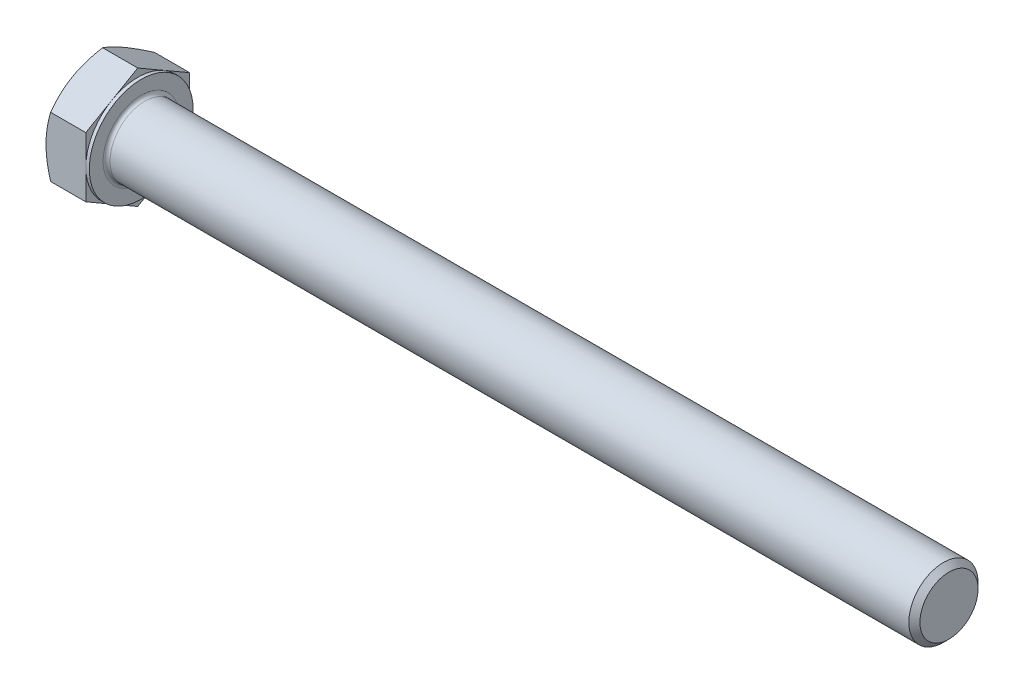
ISO-10303-21;
HEADER;
FILE_DESCRIPTION(('STEP AP214'),'2;1');
FILE_NAME('part.step','',(''),(''),'','','');
FILE_SCHEMA(('AUTOMOTIVE_DESIGN { 1 0 10303 214 1 1 1 1 }'));
ENDSEC;
DATA;
#1=APPLICATION_CONTEXT('core data for automotive mechanical design processes');
#2=APPLICATION_PROTOCOL_DEFINITION('international standard','automotive_design',2000,#1);
#3=PRODUCT_CONTEXT('',#1,'mechanical');
#4=PRODUCT('Part','Part','',(#3));
#5=PRODUCT_RELATED_PRODUCT_CATEGORY('part','',(#4));
#6=PRODUCT_DEFINITION_FORMATION('','',#4);
#7=PRODUCT_DEFINITION_CONTEXT('part definition',#1,'design');
#8=PRODUCT_DEFINITION('design','',#6,#7);
#9=PRODUCT_DEFINITION_SHAPE('','',#8);
#10=(LENGTH_UNIT() NAMED_UNIT(*) SI_UNIT(.MILLI.,.METRE.));
#11=(NAMED_UNIT(*) PLANE_ANGLE_UNIT() SI_UNIT($,.RADIAN.));
#12=(NAMED_UNIT(*) SI_UNIT($,.STERADIAN.) SOLID_ANGLE_UNIT());
#13=UNCERTAINTY_MEASURE_WITH_UNIT(LENGTH_MEASURE(1.E-05),#10,'distance_accuracy_value','');
#14=(GEOMETRIC_REPRESENTATION_CONTEXT(3) GLOBAL_UNCERTAINTY_ASSIGNED_CONTEXT((#13)) GLOBAL_UNIT_ASSIGNED_CONTEXT((#10,
#11,#12)) REPRESENTATION_CONTEXT('',''));
#15=CARTESIAN_POINT('',(0.,0.,0.));
#16=DIRECTION('',(0.,0.,1.));
#17=DIRECTION('',(1.,0.,0.));
#18=AXIS2_PLACEMENT_3D('',#15,#16,#17);
#19=CARTESIAN_POINT('',(7.5,10.3923048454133,0.));
#20=DIRECTION('',(1.,0.,0.));
#21=DIRECTION('',(0.,0.,-1.));
#22=AXIS2_PLACEMENT_3D('',#19,#20,#21);
#23=PLANE('',#22);
#24=CARTESIAN_POINT('',(7.5,0.,0.));
#25=DIRECTION('',(1.,0.,0.));
#26=DIRECTION('',(0.,0.,-1.));
#27=AXIS2_PLACEMENT_3D('',#24,#25,#26);
#28=CIRCLE('',#27,6.6);
#29=CARTESIAN_POINT('',(7.5,0.,-6.6));
#30=VERTEX_POINT('',#29);
#31=EDGE_CURVE('E40',#30,#30,#28,.F.);
#32=ORIENTED_EDGE('',*,*,#31,.T.);
#33=EDGE_LOOP('',(#32));
#34=FACE_BOUND('',#33,.T.);
#35=CARTESIAN_POINT('',(7.5,0.,0.));
#36=DIRECTION('',(1.,0.,0.));
#37=DIRECTION('',(0.,0.,-1.));
#38=AXIS2_PLACEMENT_3D('',#35,#36,#37);
#39=CIRCLE('',#38,9.);
#40=CARTESIAN_POINT('',(7.5,0.,-9.));
#41=VERTEX_POINT('',#40);
#42=EDGE_CURVE('E297',#41,#41,#39,.T.);
#43=ORIENTED_EDGE('',*,*,#42,.T.);
#44=EDGE_LOOP('',(#43));
#45=FACE_BOUND('',#44,.T.);
#46=ADVANCED_FACE('F32',(#34,#45),#23,.T.);
#47=CARTESIAN_POINT('',(0.,0.,0.));
#48=DIRECTION('',(-1.,0.,0.));
#49=DIRECTION('',(0.,0.,1.));
#50=AXIS2_PLACEMENT_3D('',#47,#48,#49);
#51=CYLINDRICAL_SURFACE('',#50,6.);
#52=CARTESIAN_POINT('',(8.1,0.,0.));
#53=DIRECTION('',(1.,0.,0.));
#54=DIRECTION('',(0.,0.,-1.));
#55=AXIS2_PLACEMENT_3D('',#52,#53,#54);
#56=CIRCLE('',#55,6.);
#57=CARTESIAN_POINT('',(8.1,0.,-6.));
#58=VERTEX_POINT('',#57);
#59=EDGE_CURVE('E11',#58,#58,#56,.T.);
#60=ORIENTED_EDGE('',*,*,#59,.T.);
#61=EDGE_LOOP('',(#60));
#62=FACE_BOUND('',#61,.T.);
#63=CARTESIAN_POINT('',(146.536,0.,0.));
#64=DIRECTION('',(-1.,0.,0.));
#65=DIRECTION('',(0.,0.,1.));
#66=AXIS2_PLACEMENT_3D('',#63,#64,#65);
#67=CIRCLE('',#66,6.);
#68=CARTESIAN_POINT('',(146.536,0.,6.));
#69=VERTEX_POINT('',#68);
#70=EDGE_CURVE('E276',#69,#69,#67,.T.);
#71=ORIENTED_EDGE('',*,*,#70,.T.);
#72=EDGE_LOOP('',(#71));
#73=FACE_BOUND('',#72,.T.);
#74=ADVANCED_FACE('F250',(#62,#73),#51,.T.);
#75=CARTESIAN_POINT('',(147.5,0.,0.));
#76=DIRECTION('',(-1.,0.,0.));
#77=DIRECTION('',(0.,0.,1.));
#78=AXIS2_PLACEMENT_3D('',#75,#76,#77);
#79=CONICAL_SURFACE('',#78,5.036,0.785398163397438);
#80=ORIENTED_EDGE('',*,*,#70,.F.);
#81=EDGE_LOOP('',(#80));
#82=FACE_BOUND('',#81,.T.);
#83=CARTESIAN_POINT('',(147.5,0.,0.));
#84=DIRECTION('',(-1.,0.,0.));
#85=DIRECTION('',(0.,0.,1.));
#86=AXIS2_PLACEMENT_3D('',#83,#84,#85);
#87=CIRCLE('',#86,5.036);
#88=CARTESIAN_POINT('',(147.5,0.,5.036));
#89=VERTEX_POINT('',#88);
#90=EDGE_CURVE('E274',#89,#89,#87,.T.);
#91=ORIENTED_EDGE('',*,*,#90,.T.);
#92=EDGE_LOOP('',(#91));
#93=FACE_BOUND('',#92,.T.);
#94=ADVANCED_FACE('F255',(#82,#93),#79,.T.);
#95=CARTESIAN_POINT('',(147.5,0.,0.));
#96=DIRECTION('',(-1.,0.,0.));
#97=DIRECTION('',(0.,0.,1.));
#98=AXIS2_PLACEMENT_3D('',#95,#96,#97);
#99=PLANE('',#98);
#100=ORIENTED_EDGE('',*,*,#90,.F.);
#101=EDGE_LOOP('',(#100));
#102=FACE_BOUND('',#101,.T.);
#103=ADVANCED_FACE('F262',(#102),#99,.F.);
#104=CARTESIAN_POINT('',(6.9,9.,0.));
#105=DIRECTION('',(1.,0.,0.));
#106=DIRECTION('',(0.,0.,-1.));
#107=AXIS2_PLACEMENT_3D('',#104,#105,#106);
#108=PLANE('',#107);
#109=DIRECTION('',(0.,0.500000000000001,0.866025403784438));
#110=VECTOR('',#109,1.);
#111=CARTESIAN_POINT('',(6.9,5.19615242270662,-9.));
#112=LINE('',#111,#110);
#113=CARTESIAN_POINT('',(6.9,5.19615242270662,-9.));
#114=VERTEX_POINT('',#113);
#115=CARTESIAN_POINT('',(6.9,7.79422863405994,-4.50000000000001));
#116=VERTEX_POINT('',#115);
#117=EDGE_CURVE('E164',#114,#116,#112,.T.);
#118=ORIENTED_EDGE('',*,*,#117,.T.);
#119=CARTESIAN_POINT('',(6.9,0.,0.));
#120=DIRECTION('',(-1.,0.,0.));
#121=DIRECTION('',(0.,0.,1.));
#122=AXIS2_PLACEMENT_3D('',#119,#120,#121);
#123=CIRCLE('',#122,9.);
#124=CARTESIAN_POINT('',(6.9,0.,-9.));
#125=VERTEX_POINT('',#124);
#126=EDGE_CURVE('E47',#116,#125,#123,.T.);
#127=ORIENTED_EDGE('',*,*,#126,.T.);
#128=DIRECTION('',(0.,1.,0.));
#129=VECTOR('',#128,1.);
#130=CARTESIAN_POINT('',(6.9,5.19615242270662,-9.));
#131=LINE('',#130,#129);
#132=EDGE_CURVE('E300',#125,#114,#131,.T.);
#133=ORIENTED_EDGE('',*,*,#132,.T.);
#134=EDGE_LOOP('',(#118,#127,#133));
#135=FACE_BOUND('',#134,.T.);
#136=ADVANCED_FACE('F265',(#135),#108,.T.);
#137=CARTESIAN_POINT('',(6.9,10.3923048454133,0.));
#138=VERTEX_POINT('',#137);
#139=EDGE_CURVE('E162',#116,#138,#112,.T.);
#140=ORIENTED_EDGE('',*,*,#139,.T.);
#141=DIRECTION('',(0.,-0.500000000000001,0.866025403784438));
#142=VECTOR('',#141,1.);
#143=CARTESIAN_POINT('',(6.9,10.3923048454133,0.));
#144=LINE('',#143,#142);
#145=CARTESIAN_POINT('',(6.9,7.79422863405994,4.50000000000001));
#146=VERTEX_POINT('',#145);
#147=EDGE_CURVE('E161',#138,#146,#144,.T.);
#148=ORIENTED_EDGE('',*,*,#147,.T.);
#149=EDGE_CURVE('E150',#146,#116,#123,.T.);
#150=ORIENTED_EDGE('',*,*,#149,.T.);
#151=EDGE_LOOP('',(#140,#148,#150));
#152=FACE_BOUND('',#151,.T.);
#153=ADVANCED_FACE('F270',(#152),#108,.T.);
#154=CARTESIAN_POINT('',(6.9,5.19615242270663,9.));
#155=VERTEX_POINT('',#154);
#156=EDGE_CURVE('E129',#146,#155,#144,.T.);
#157=ORIENTED_EDGE('',*,*,#156,.T.);
#158=DIRECTION('',(0.,-1.,0.));
#159=VECTOR('',#158,1.);
#160=CARTESIAN_POINT('',(6.9,5.19615242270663,9.));
#161=LINE('',#160,#159);
#162=CARTESIAN_POINT('',(6.9,0.,9.));
#163=VERTEX_POINT('',#162);
#164=EDGE_CURVE('E123',#155,#163,#161,.T.);
#165=ORIENTED_EDGE('',*,*,#164,.T.);
#166=EDGE_CURVE('E127',#163,#146,#123,.T.);
#167=ORIENTED_EDGE('',*,*,#166,.T.);
#168=EDGE_LOOP('',(#157,#165,#167));
#169=FACE_BOUND('',#168,.T.);
#170=ADVANCED_FACE('F125',(#169),#108,.T.);
#171=CARTESIAN_POINT('',(6.9,-5.19615242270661,9.));
#172=VERTEX_POINT('',#171);
#173=EDGE_CURVE('E133',#163,#172,#161,.T.);
#174=ORIENTED_EDGE('',*,*,#173,.T.);
#175=DIRECTION('',(0.,-0.500000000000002,-0.866025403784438));
#176=VECTOR('',#175,1.);
#177=CARTESIAN_POINT('',(6.9,-10.3923048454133,0.));
#178=LINE('',#177,#176);
#179=CARTESIAN_POINT('',(6.9,-7.79422863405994,4.50000000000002));
#180=VERTEX_POINT('',#179);
#181=EDGE_CURVE('E140',#172,#180,#178,.T.);
#182=ORIENTED_EDGE('',*,*,#181,.T.);
#183=EDGE_CURVE('E137',#180,#163,#123,.T.);
#184=ORIENTED_EDGE('',*,*,#183,.T.);
#185=EDGE_LOOP('',(#174,#182,#184));
#186=FACE_BOUND('',#185,.T.);
#187=ADVANCED_FACE('F138',(#186),#108,.T.);
#188=CARTESIAN_POINT('',(6.9,-10.3923048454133,0.));
#189=VERTEX_POINT('',#188);
#190=EDGE_CURVE('E156',#180,#189,#178,.T.);
#191=ORIENTED_EDGE('',*,*,#190,.T.);
#192=DIRECTION('',(0.,0.5,-0.866025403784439));
#193=VECTOR('',#192,1.);
#194=CARTESIAN_POINT('',(6.9,-5.19615242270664,-9.));
#195=LINE('',#194,#193);
#196=CARTESIAN_POINT('',(6.9,-7.79422863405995,-4.5));
#197=VERTEX_POINT('',#196);
#198=EDGE_CURVE('E338',#189,#197,#195,.T.);
#199=ORIENTED_EDGE('',*,*,#198,.T.);
#200=EDGE_CURVE('E144',#197,#180,#123,.T.);
#201=ORIENTED_EDGE('',*,*,#200,.T.);
#202=EDGE_LOOP('',(#191,#199,#201));
#203=FACE_BOUND('',#202,.T.);
#204=ADVANCED_FACE('F339',(#203),#108,.T.);
#205=CARTESIAN_POINT('',(6.9,-5.19615242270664,-9.));
#206=VERTEX_POINT('',#205);
#207=EDGE_CURVE('E151',#197,#206,#195,.T.);
#208=ORIENTED_EDGE('',*,*,#207,.T.);
#209=EDGE_CURVE('E301',#206,#125,#131,.T.);
#210=ORIENTED_EDGE('',*,*,#209,.T.);
#211=EDGE_CURVE('E308',#125,#197,#123,.T.);
#212=ORIENTED_EDGE('',*,*,#211,.T.);
#213=EDGE_LOOP('',(#208,#210,#212));
#214=FACE_BOUND('',#213,.T.);
#215=ADVANCED_FACE('F271',(#214),#108,.T.);
#216=CARTESIAN_POINT('',(0.,0.,0.));
#217=DIRECTION('',(-1.,0.,0.));
#218=DIRECTION('',(0.,0.,1.));
#219=AXIS2_PLACEMENT_3D('',#216,#217,#218);
#220=CYLINDRICAL_SURFACE('',#219,9.);
#221=ORIENTED_EDGE('',*,*,#126,.F.);
#222=ORIENTED_EDGE('',*,*,#149,.F.);
#223=ORIENTED_EDGE('',*,*,#166,.F.);
#224=ORIENTED_EDGE('',*,*,#183,.F.);
#225=ORIENTED_EDGE('',*,*,#200,.F.);
#226=ORIENTED_EDGE('',*,*,#211,.F.);
#227=EDGE_LOOP('',(#221,#222,#223,#224,#225,#226));
#228=FACE_BOUND('',#227,.T.);
#229=ORIENTED_EDGE('',*,*,#42,.F.);
#230=EDGE_LOOP('',(#229));
#231=FACE_BOUND('',#230,.T.);
#232=ADVANCED_FACE('F147',(#228,#231),#220,.T.);
#233=CARTESIAN_POINT('',(0.,10.3923048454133,0.));
#234=DIRECTION('',(1.,0.,0.));
#235=DIRECTION('',(0.,0.,-1.));
#236=AXIS2_PLACEMENT_3D('',#233,#234,#235);
#237=PLANE('',#236);
#238=CARTESIAN_POINT('',(0.,0.,0.));
#239=DIRECTION('',(1.,0.,0.));
#240=DIRECTION('',(0.,0.,-1.));
#241=AXIS2_PLACEMENT_3D('',#238,#239,#240);
#242=CIRCLE('',#241,9.);
#243=CARTESIAN_POINT('',(0.,0.,-9.));
#244=VERTEX_POINT('',#243);
#245=CARTESIAN_POINT('',(0.,7.79422863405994,-4.50000000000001));
#246=VERTEX_POINT('',#245);
#247=EDGE_CURVE('E296',#244,#246,#242,.T.);
#248=ORIENTED_EDGE('',*,*,#247,.F.);
#249=CARTESIAN_POINT('',(0.,-7.79422863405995,-4.5));
#250=VERTEX_POINT('',#249);
#251=EDGE_CURVE('E292',#250,#244,#242,.T.);
#252=ORIENTED_EDGE('',*,*,#251,.F.);
#253=CARTESIAN_POINT('',(0.,-7.79422863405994,4.50000000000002));
#254=VERTEX_POINT('',#253);
#255=EDGE_CURVE('E295',#254,#250,#242,.T.);
#256=ORIENTED_EDGE('',*,*,#255,.F.);
#257=CARTESIAN_POINT('',(0.,0.,9.));
#258=VERTEX_POINT('',#257);
#259=EDGE_CURVE('E331',#258,#254,#242,.T.);
#260=ORIENTED_EDGE('',*,*,#259,.F.);
#261=CARTESIAN_POINT('',(0.,0.,0.));
#262=DIRECTION('',(-1.,0.,0.));
#263=DIRECTION('',(0.,0.,1.));
#264=AXIS2_PLACEMENT_3D('',#261,#262,#263);
#265=CIRCLE('',#264,9.);
#266=CARTESIAN_POINT('',(0.,7.79422863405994,4.50000000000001));
#267=VERTEX_POINT('',#266);
#268=EDGE_CURVE('E165',#258,#267,#265,.T.);
#269=ORIENTED_EDGE('',*,*,#268,.T.);
#270=EDGE_CURVE('E354',#246,#267,#242,.T.);
#271=ORIENTED_EDGE('',*,*,#270,.F.);
#272=EDGE_LOOP('',(#248,#252,#256,#260,#269,#271));
#273=FACE_BOUND('',#272,.T.);
#274=ADVANCED_FACE('F196',(#273),#237,.F.);
#275=CARTESIAN_POINT('',(0.,0.,0.));
#276=DIRECTION('',(1.,0.,0.));
#277=DIRECTION('',(0.,0.,-1.));
#278=AXIS2_PLACEMENT_3D('',#275,#276,#277);
#279=CONICAL_SURFACE('',#278,9.,1.0471975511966);
#280=CARTESIAN_POINT('',(0.803914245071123,5.19603695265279,9.0002));
#281=CARTESIAN_POINT('',(0.737982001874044,5.31024090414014,8.80239295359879));
#282=CARTESIAN_POINT('',(0.675041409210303,5.42489028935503,8.60381439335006));
#283=CARTESIAN_POINT('',(0.555968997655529,5.65512011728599,8.20504463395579));
#284=CARTESIAN_POINT('',(0.499840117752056,5.77070093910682,8.00485277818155));
#285=CARTESIAN_POINT('',(0.395151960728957,6.00300811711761,7.60248494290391));
#286=CARTESIAN_POINT('',(0.346610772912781,6.11973652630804,7.40030540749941));
#287=CARTESIAN_POINT('',(0.258148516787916,6.35398725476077,6.99457124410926));
#288=CARTESIAN_POINT('',(0.218225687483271,6.47150940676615,6.7910169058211));
#289=CARTESIAN_POINT('',(0.148684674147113,6.70436794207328,6.38769409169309));
#290=CARTESIAN_POINT('',(0.118837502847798,6.81968712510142,6.187955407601));
#291=CARTESIAN_POINT('',(0.0687933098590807,7.05084147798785,5.78758432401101));
#292=CARTESIAN_POINT('',(0.04859543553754,7.16667660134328,5.5869520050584));
#293=CARTESIAN_POINT('',(0.0183543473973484,7.39854776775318,5.18533936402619));
#294=CARTESIAN_POINT('',(0.00829960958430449,7.51458343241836,4.98435969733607));
#295=CARTESIAN_POINT('',(-0.00143766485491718,7.74676155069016,4.58221540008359));
#296=CARTESIAN_POINT('',(-0.00112052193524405,7.86290400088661,4.38105077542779));
#297=CARTESIAN_POINT('',(0.00916395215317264,8.08003584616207,4.00496738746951));
#298=CARTESIAN_POINT('',(0.0178767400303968,8.18104055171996,3.83002210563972));
#299=CARTESIAN_POINT('',(0.0429773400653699,8.38281337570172,3.48054132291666));
#300=CARTESIAN_POINT('',(0.0593656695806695,8.4835814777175,3.30600585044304));
#301=CARTESIAN_POINT('',(0.11965655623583,8.7854956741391,2.7830751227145));
#302=CARTESIAN_POINT('',(0.174677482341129,8.98610736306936,2.43560548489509));
#303=CARTESIAN_POINT('',(0.312230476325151,9.38945876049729,1.73698037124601));
#304=CARTESIAN_POINT('',(0.395345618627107,9.59214699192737,1.38591405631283));
#305=CARTESIAN_POINT('',(0.583982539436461,9.99450087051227,0.689016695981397));
#306=CARTESIAN_POINT('',(0.689460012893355,10.1941716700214,0.343176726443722));
#307=CARTESIAN_POINT('',(0.803914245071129,10.3924203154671,-0.000200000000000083));
#308=B_SPLINE_CURVE_WITH_KNOTS('',3,(#280,#281,#282,#283,#284,#285,#286,#287,#288,#289,#290,
#291,#292,#293,#294,#295,#296,#297,#298,#299,#300,#301,#302,#303,#304,#305,#306,#307),
.UNSPECIFIED.,.F.,.F.,(4,2,2,2,2,2,2,2,2,2,2,2,2,4),(0.,0.713219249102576,1.42674513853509,
2.14194697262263,2.8570025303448,3.55449749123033,4.25193080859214,4.94857085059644,
5.64518936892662,6.25162976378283,6.8581110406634,8.07193747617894,9.31268391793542,
10.5509947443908),.UNSPECIFIED.);
#309=CARTESIAN_POINT('',(0.803847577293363,10.3923048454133,0.));
#310=VERTEX_POINT('',#309);
#311=EDGE_CURVE('E216',#267,#310,#308,.T.);
#312=ORIENTED_EDGE('',*,*,#311,.T.);
#313=CARTESIAN_POINT('',(0.803914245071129,10.3924203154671,0.0002));
#314=CARTESIAN_POINT('',(0.73798200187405,10.2782163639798,-0.197607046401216));
#315=CARTESIAN_POINT('',(0.675041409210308,10.1635669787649,-0.396185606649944));
#316=CARTESIAN_POINT('',(0.555968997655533,9.93333715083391,-0.794955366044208));
#317=CARTESIAN_POINT('',(0.49984011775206,9.81775632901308,-0.995147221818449));
#318=CARTESIAN_POINT('',(0.395151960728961,9.58544915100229,-1.3975150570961));
#319=CARTESIAN_POINT('',(0.346610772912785,9.46872074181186,-1.5996945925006));
#320=CARTESIAN_POINT('',(0.258148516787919,9.23447001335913,-2.00542875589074));
#321=CARTESIAN_POINT('',(0.218225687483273,9.11694786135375,-2.20898309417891));
#322=CARTESIAN_POINT('',(0.148684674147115,8.88408932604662,-2.61230590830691));
#323=CARTESIAN_POINT('',(0.1188375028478,8.76877014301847,-2.812044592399));
#324=CARTESIAN_POINT('',(0.0687933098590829,8.53761579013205,-3.21241567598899));
#325=CARTESIAN_POINT('',(0.0485954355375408,8.42178066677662,-3.4130479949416));
#326=CARTESIAN_POINT('',(0.0183543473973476,8.18990950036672,-3.81466063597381));
#327=CARTESIAN_POINT('',(0.00829960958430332,8.07387383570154,-4.01564030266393));
#328=CARTESIAN_POINT('',(-0.00143766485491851,7.84169571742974,-4.41778459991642));
#329=CARTESIAN_POINT('',(-0.00112052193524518,7.72555326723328,-4.61894922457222));
#330=CARTESIAN_POINT('',(0.00916395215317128,7.50842142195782,-4.9950326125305));
#331=CARTESIAN_POINT('',(0.0178767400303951,7.40741671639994,-5.16997789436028));
#332=CARTESIAN_POINT('',(0.0429773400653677,7.20564389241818,-5.51945867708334));
#333=CARTESIAN_POINT('',(0.0593656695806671,7.1048757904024,-5.69399414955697));
#334=CARTESIAN_POINT('',(0.119656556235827,6.8029615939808,-6.2169248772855));
#335=CARTESIAN_POINT('',(0.174677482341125,6.60234990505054,-6.56439451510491));
#336=CARTESIAN_POINT('',(0.312230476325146,6.1989985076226,-7.263019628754));
#337=CARTESIAN_POINT('',(0.395345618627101,5.99631027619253,-7.61408594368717));
#338=CARTESIAN_POINT('',(0.583982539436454,5.59395639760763,-8.3109833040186));
#339=CARTESIAN_POINT('',(0.689460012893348,5.39428559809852,-8.65682327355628));
#340=CARTESIAN_POINT('',(0.803914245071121,5.19603695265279,-9.0002));
#341=B_SPLINE_CURVE_WITH_KNOTS('',3,(#313,#314,#315,#316,#317,#318,#319,#320,#321,#322,#323,
#324,#325,#326,#327,#328,#329,#330,#331,#332,#333,#334,#335,#336,#337,#338,#339,#340),
.UNSPECIFIED.,.F.,.F.,(4,2,2,2,2,2,2,2,2,2,2,2,2,4),(0.,0.713219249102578,1.42674513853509,
2.14194697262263,2.8570025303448,3.55449749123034,4.25193080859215,4.94857085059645,
5.64518936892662,6.25162976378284,6.8581110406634,8.07193747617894,9.31268391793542,
10.5509947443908),.UNSPECIFIED.);
#342=EDGE_CURVE('E55',#310,#246,#341,.T.);
#343=ORIENTED_EDGE('',*,*,#342,.T.);
#344=ORIENTED_EDGE('',*,*,#270,.T.);
#345=EDGE_LOOP('',(#312,#343,#344));
#346=FACE_BOUND('',#345,.T.);
#347=ADVANCED_FACE('F355',(#346),#279,.T.);
#348=CARTESIAN_POINT('',(4.50308345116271,-14.1853984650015,8.99999999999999));
#349=CARTESIAN_POINT('',(4.31054430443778,-13.7903499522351,8.99999999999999));
#350=CARTESIAN_POINT('',(4.11978647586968,-13.3944187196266,8.99999999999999));
#351=CARTESIAN_POINT('',(3.74283090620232,-12.6003222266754,8.99999999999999));
#352=CARTESIAN_POINT('',(3.55663384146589,-12.2021566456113,9.));
#353=CARTESIAN_POINT('',(3.18890856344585,-11.4011783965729,9.));
#354=CARTESIAN_POINT('',(3.00740939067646,-10.9983523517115,9.));
#355=CARTESIAN_POINT('',(2.65153988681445,-10.1895752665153,9.));
#356=CARTESIAN_POINT('',(2.4771692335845,-9.78362436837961,9.));
#357=CARTESIAN_POINT('',(2.13161244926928,-8.95398189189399,9.));
#358=CARTESIAN_POINT('',(1.96074001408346,-8.53015895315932,9.));
#359=CARTESIAN_POINT('',(1.63138410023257,-7.6776404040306,9.));
#360=CARTESIAN_POINT('',(1.47290197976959,-7.24894426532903,9.));
#361=CARTESIAN_POINT('',(1.17232155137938,-6.38672363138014,9.));
#362=CARTESIAN_POINT('',(1.03019194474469,-5.95321016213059,9.));
#363=CARTESIAN_POINT('',(0.766724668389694,-5.07998336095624,9.));
#364=CARTESIAN_POINT('',(0.645380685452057,-4.64027195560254,9.));
#365=CARTESIAN_POINT('',(0.429822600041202,-3.75682505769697,9.));
#366=CARTESIAN_POINT('',(0.335452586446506,-3.31312863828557,9.));
#367=CARTESIAN_POINT('',(0.218090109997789,-2.6433671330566,9.));
#368=CARTESIAN_POINT('',(0.182999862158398,-2.41939560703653,9.));
#369=CARTESIAN_POINT('',(0.121565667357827,-1.9702635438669,9.));
#370=CARTESIAN_POINT('',(0.095220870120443,-1.74510312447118,9.));
#371=CARTESIAN_POINT('',(0.0521451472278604,-1.29693480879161,9.));
#372=CARTESIAN_POINT('',(0.0352889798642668,-1.07393900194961,9.));
#373=CARTESIAN_POINT('',(0.0110310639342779,-0.627433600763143,9.));
#374=CARTESIAN_POINT('',(0.00362915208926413,-0.403924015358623,9.));
#375=CARTESIAN_POINT('',(-0.00154262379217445,0.0432079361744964,9.));
#376=CARTESIAN_POINT('',(0.000687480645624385,0.266830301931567,9.));
#377=CARTESIAN_POINT('',(0.0147226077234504,0.713776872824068,9.));
#378=CARTESIAN_POINT('',(0.0265280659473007,0.937101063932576,9.));
#379=CARTESIAN_POINT('',(0.065650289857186,1.46707211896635,9.));
#380=CARTESIAN_POINT('',(0.0971347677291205,1.77341845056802,9.));
#381=CARTESIAN_POINT('',(0.176454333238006,2.38397028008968,9.));
#382=CARTESIAN_POINT('',(0.224291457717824,2.68817550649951,9.));
#383=CARTESIAN_POINT('',(0.389806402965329,3.59715813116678,9.));
#384=CARTESIAN_POINT('',(0.52946189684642,4.19799412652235,9.));
#385=CARTESIAN_POINT('',(0.773331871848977,5.09670706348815,9.));
#386=CARTESIAN_POINT('',(0.861532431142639,5.399199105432,9.));
#387=CARTESIAN_POINT('',(1.04752099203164,6.00125026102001,9.));
#388=CARTESIAN_POINT('',(1.14530906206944,6.30080935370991,9.));
#389=CARTESIAN_POINT('',(1.34886866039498,6.89708058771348,9.));
#390=CARTESIAN_POINT('',(1.45463787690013,7.19379352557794,9.));
#391=CARTESIAN_POINT('',(1.67287301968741,7.78473287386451,9.));
#392=CARTESIAN_POINT('',(1.78533883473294,8.07895932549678,9.));
#393=CARTESIAN_POINT('',(2.07523735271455,8.81619444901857,9.));
#394=CARTESIAN_POINT('',(2.25629467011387,9.25777584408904,9.));
#395=CARTESIAN_POINT('',(2.62827522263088,10.1367776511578,9.));
#396=CARTESIAN_POINT('',(2.819199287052,10.5741977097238,9.));
#397=CARTESIAN_POINT('',(3.20877963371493,11.4457286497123,9.));
#398=CARTESIAN_POINT('',(3.40743823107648,11.8798384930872,9.));
#399=CARTESIAN_POINT('',(3.81079737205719,12.7452179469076,9.));
#400=CARTESIAN_POINT('',(4.01549773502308,13.176487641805,9.00000000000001));
#401=CARTESIAN_POINT('',(4.43000777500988,14.0372827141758,9.00000000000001));
#402=CARTESIAN_POINT('',(4.63982402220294,14.4668049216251,9.00000000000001));
#403=CARTESIAN_POINT('',(5.06336871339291,15.3239162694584,9.00000000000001));
#404=CARTESIAN_POINT('',(5.27709718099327,15.7515053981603,9.00000000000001));
#405=CARTESIAN_POINT('',(5.70771289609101,16.6049951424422,9.00000000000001));
#406=CARTESIAN_POINT('',(5.92459958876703,17.0308960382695,9.00000000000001));
#407=CARTESIAN_POINT('',(6.36101693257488,17.8813418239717,9.00000000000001));
#408=CARTESIAN_POINT('',(6.58054759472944,18.305886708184,9.00000000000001));
#409=CARTESIAN_POINT('',(7.2009668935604,19.4981240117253,9.00000000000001));
#410=CARTESIAN_POINT('',(7.60436223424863,20.2645118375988,9.00000000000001));
#411=CARTESIAN_POINT('',(8.41646747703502,21.7945065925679,9.00000000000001));
#412=CARTESIAN_POINT('',(8.82517763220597,22.558113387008,9.00000000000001));
#413=CARTESIAN_POINT('',(9.64538992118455,24.0808854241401,9.00000000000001));
#414=CARTESIAN_POINT('',(10.0568800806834,24.8400571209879,9.00000000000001));
#415=CARTESIAN_POINT('',(10.6764233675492,25.9775231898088,9.00000000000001));
#416=CARTESIAN_POINT('',(10.8833155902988,26.3564507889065,9.00000000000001));
#417=CARTESIAN_POINT('',(11.2977907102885,27.1139273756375,9.00000000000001));
#418=CARTESIAN_POINT('',(11.5053736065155,27.492476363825,9.00000000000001));
#419=CARTESIAN_POINT('',(11.7132605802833,27.8708583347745,9.00000000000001));
#420=B_SPLINE_CURVE_WITH_KNOTS('',3,(#348,#349,#350,#351,#352,#353,#354,#355,#356,#357,#358,
#359,#360,#361,#362,#363,#364,#365,#366,#367,#368,#369,#370,#371,#372,#373,#374,#375,#376,#377,
#378,#379,#380,#381,#382,#383,#384,#385,#386,#387,#388,#389,#390,#391,#392,#393,#394,#395,#396,
#397,#398,#399,#400,#401,#402,#403,#404,#405,#406,#407,#408,#409,#410,#411,#412,#413,#414,#415,
#416,#417,#418,#419),.UNSPECIFIED.,.F.,.F.,(4,2,2,2,2,2,2,2,2,2,2,2,2,2,2,2,2,2,2,2,2,2,2,2,2,2,
2,2,2,2,2,2,2,2,2,4),(0.,1.31842765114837,2.6370496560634,3.96247407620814,5.28783853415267,
6.65860358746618,8.02951869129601,9.3977646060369,10.7655942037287,12.1253499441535,
12.8053173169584,13.4852185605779,14.1559216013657,14.8266130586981,15.4973023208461,
16.1680220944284,17.0913849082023,18.0148627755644,19.862742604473,20.8079230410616,
21.7531102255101,22.6980246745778,23.6429234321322,25.0745302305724,26.5062575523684,
27.9384167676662,29.3705332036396,30.8045973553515,32.2386701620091,33.6724940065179,
35.1063238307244,37.7045032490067,40.3028068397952,42.8933552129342,44.1885437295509,
45.4837303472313),.UNSPECIFIED.);
#421=CARTESIAN_POINT('',(0.803847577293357,5.19615242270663,9.));
#422=VERTEX_POINT('',#421);
#423=EDGE_CURVE('E230',#258,#422,#420,.T.);
#424=ORIENTED_EDGE('',*,*,#423,.T.);
#425=EDGE_CURVE('E229',#422,#267,#308,.T.);
#426=ORIENTED_EDGE('',*,*,#425,.T.);
#427=ORIENTED_EDGE('',*,*,#268,.F.);
#428=EDGE_LOOP('',(#424,#426,#427));
#429=FACE_BOUND('',#428,.T.);
#430=ADVANCED_FACE('F325',(#429),#279,.T.);
#431=CARTESIAN_POINT('',(0.80384757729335,-5.19615242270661,9.));
#432=VERTEX_POINT('',#431);
#433=EDGE_CURVE('E277',#432,#258,#420,.T.);
#434=ORIENTED_EDGE('',*,*,#433,.T.);
#435=ORIENTED_EDGE('',*,*,#259,.T.);
#436=CARTESIAN_POINT('',(0.803914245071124,-10.3924203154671,-0.000200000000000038));
#437=CARTESIAN_POINT('',(0.737982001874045,-10.2782163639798,0.197607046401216));
#438=CARTESIAN_POINT('',(0.675041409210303,-10.1635669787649,0.396185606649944));
#439=CARTESIAN_POINT('',(0.555968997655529,-9.9333371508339,0.794955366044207));
#440=CARTESIAN_POINT('',(0.499840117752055,-9.81775632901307,0.995147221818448));
#441=CARTESIAN_POINT('',(0.395151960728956,-9.58544915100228,1.39751505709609));
#442=CARTESIAN_POINT('',(0.34661077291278,-9.46872074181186,1.59969459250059));
#443=CARTESIAN_POINT('',(0.258148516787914,-9.23447001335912,2.00542875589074));
#444=CARTESIAN_POINT('',(0.218225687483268,-9.11694786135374,2.2089830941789));
#445=CARTESIAN_POINT('',(0.148684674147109,-8.88408932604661,2.61230590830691));
#446=CARTESIAN_POINT('',(0.118837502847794,-8.76877014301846,2.812044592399));
#447=CARTESIAN_POINT('',(0.0687933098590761,-8.53761579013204,3.21241567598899));
#448=CARTESIAN_POINT('',(0.0485954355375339,-8.42178066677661,3.4130479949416));
#449=CARTESIAN_POINT('',(0.0183543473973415,-8.18990950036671,3.81466063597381));
#450=CARTESIAN_POINT('',(0.00829960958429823,-8.07387383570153,4.01564030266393));
#451=CARTESIAN_POINT('',(-0.00143766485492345,-7.84169571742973,4.41778459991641));
#452=CARTESIAN_POINT('',(-0.00112052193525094,-7.72555326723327,4.61894922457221));
#453=CARTESIAN_POINT('',(0.00916395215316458,-7.50842142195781,4.99503261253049));
#454=CARTESIAN_POINT('',(0.0178767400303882,-7.40741671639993,5.16997789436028));
#455=CARTESIAN_POINT('',(0.0429773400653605,-7.20564389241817,5.51945867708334));
#456=CARTESIAN_POINT('',(0.0593656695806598,-7.10487579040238,5.69399414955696));
#457=CARTESIAN_POINT('',(0.11965655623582,-6.80296159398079,6.2169248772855));
#458=CARTESIAN_POINT('',(0.174677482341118,-6.60234990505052,6.56439451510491));
#459=CARTESIAN_POINT('',(0.31223047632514,-6.19899850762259,7.26301962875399));
#460=CARTESIAN_POINT('',(0.395345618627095,-5.99631027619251,7.61408594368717));
#461=CARTESIAN_POINT('',(0.583982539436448,-5.59395639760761,8.3109833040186));
#462=CARTESIAN_POINT('',(0.689460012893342,-5.39428559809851,8.65682327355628));
#463=CARTESIAN_POINT('',(0.803914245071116,-5.19603695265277,9.0002));
#464=B_SPLINE_CURVE_WITH_KNOTS('',3,(#436,#437,#438,#439,#440,#441,#442,#443,#444,#445,#446,
#447,#448,#449,#450,#451,#452,#453,#454,#455,#456,#457,#458,#459,#460,#461,#462,#463),
.UNSPECIFIED.,.F.,.F.,(4,2,2,2,2,2,2,2,2,2,2,2,2,4),(0.,0.713219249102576,1.42674513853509,
2.14194697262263,2.8570025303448,3.55449749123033,4.25193080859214,4.94857085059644,
5.64518936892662,6.25162976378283,6.8581110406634,8.07193747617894,9.31268391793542,
10.5509947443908),.UNSPECIFIED.);
#465=EDGE_CURVE('E218',#254,#432,#464,.T.);
#466=ORIENTED_EDGE('',*,*,#465,.T.);
#467=EDGE_LOOP('',(#434,#435,#466));
#468=FACE_BOUND('',#467,.T.);
#469=ADVANCED_FACE('F185',(#468),#279,.T.);
#470=CARTESIAN_POINT('',(0.803847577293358,-10.3923048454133,0.));
#471=VERTEX_POINT('',#470);
#472=EDGE_CURVE('E210',#471,#254,#464,.T.);
#473=ORIENTED_EDGE('',*,*,#472,.T.);
#474=ORIENTED_EDGE('',*,*,#255,.T.);
#475=CARTESIAN_POINT('',(0.803914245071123,-5.1960369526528,-9.0002));
#476=CARTESIAN_POINT('',(0.737982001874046,-5.31024090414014,-8.80239295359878));
#477=CARTESIAN_POINT('',(0.675041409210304,-5.42489028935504,-8.60381439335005));
#478=CARTESIAN_POINT('',(0.555968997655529,-5.655120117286,-8.20504463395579));
#479=CARTESIAN_POINT('',(0.499840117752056,-5.77070093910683,-8.00485277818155));
#480=CARTESIAN_POINT('',(0.395151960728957,-6.00300811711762,-7.6024849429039));
#481=CARTESIAN_POINT('',(0.346610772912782,-6.11973652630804,-7.4003054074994));
#482=CARTESIAN_POINT('',(0.258148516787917,-6.35398725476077,-6.99457124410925));
#483=CARTESIAN_POINT('',(0.218225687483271,-6.47150940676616,-6.79101690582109));
#484=CARTESIAN_POINT('',(0.148684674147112,-6.70436794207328,-6.38769409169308));
#485=CARTESIAN_POINT('',(0.118837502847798,-6.81968712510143,-6.187955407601));
#486=CARTESIAN_POINT('',(0.0687933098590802,-7.05084147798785,-5.787584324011));
#487=CARTESIAN_POINT('',(0.0485954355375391,-7.16667660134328,-5.58695200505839));
#488=CARTESIAN_POINT('',(0.0183543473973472,-7.39854776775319,-5.18533936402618));
#489=CARTESIAN_POINT('',(0.00829960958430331,-7.51458343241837,-4.98435969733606));
#490=CARTESIAN_POINT('',(-0.00143766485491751,-7.74676155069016,-4.58221540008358));
#491=CARTESIAN_POINT('',(-0.00112052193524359,-7.86290400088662,-4.38105077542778));
#492=CARTESIAN_POINT('',(0.00916395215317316,-8.08003584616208,-4.0049673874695));
#493=CARTESIAN_POINT('',(0.0178767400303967,-8.18104055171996,-3.83002210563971));
#494=CARTESIAN_POINT('',(0.0429773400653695,-8.38281337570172,-3.48054132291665));
#495=CARTESIAN_POINT('',(0.0593656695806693,-8.48358147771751,-3.30600585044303));
#496=CARTESIAN_POINT('',(0.11965655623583,-8.7854956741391,-2.7830751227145));
#497=CARTESIAN_POINT('',(0.174677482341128,-8.98610736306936,-2.43560548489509));
#498=CARTESIAN_POINT('',(0.312230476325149,-9.38945876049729,-1.736980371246));
#499=CARTESIAN_POINT('',(0.395345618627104,-9.59214699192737,-1.38591405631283));
#500=CARTESIAN_POINT('',(0.583982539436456,-9.99450087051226,-0.689016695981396));
#501=CARTESIAN_POINT('',(0.68946001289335,-10.1941716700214,-0.343176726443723));
#502=CARTESIAN_POINT('',(0.803914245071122,-10.3924203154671,0.000199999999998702));
#503=B_SPLINE_CURVE_WITH_KNOTS('',3,(#475,#476,#477,#478,#479,#480,#481,#482,#483,#484,#485,
#486,#487,#488,#489,#490,#491,#492,#493,#494,#495,#496,#497,#498,#499,#500,#501,#502),
.UNSPECIFIED.,.F.,.F.,(4,2,2,2,2,2,2,2,2,2,2,2,2,4),(0.,0.713219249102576,1.42674513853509,
2.14194697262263,2.8570025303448,3.55449749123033,4.25193080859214,4.94857085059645,
5.64518936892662,6.25162976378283,6.8581110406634,8.07193747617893,9.31268391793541,
10.5509947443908),.UNSPECIFIED.);
#504=EDGE_CURVE('E217',#250,#471,#503,.T.);
#505=ORIENTED_EDGE('',*,*,#504,.T.);
#506=EDGE_LOOP('',(#473,#474,#505));
#507=FACE_BOUND('',#506,.T.);
#508=ADVANCED_FACE('F353',(#507),#279,.T.);
#509=CARTESIAN_POINT('',(0.803847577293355,5.19615242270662,-9.));
#510=VERTEX_POINT('',#509);
#511=EDGE_CURVE('E219',#246,#510,#341,.T.);
#512=ORIENTED_EDGE('',*,*,#511,.T.);
#513=CARTESIAN_POINT('',(4.50308345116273,-14.1853984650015,-8.99999999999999));
#514=CARTESIAN_POINT('',(4.3105443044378,-13.7903499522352,-8.99999999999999));
#515=CARTESIAN_POINT('',(4.11978647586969,-13.3944187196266,-8.99999999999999));
#516=CARTESIAN_POINT('',(3.74283090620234,-12.6003222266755,-8.99999999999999));
#517=CARTESIAN_POINT('',(3.5566338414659,-12.2021566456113,-9.));
#518=CARTESIAN_POINT('',(3.18890856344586,-11.4011783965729,-9.));
#519=CARTESIAN_POINT('',(3.00740939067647,-10.9983523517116,-9.));
#520=CARTESIAN_POINT('',(2.65153988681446,-10.1895752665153,-9.));
#521=CARTESIAN_POINT('',(2.47716923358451,-9.78362436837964,-9.));
#522=CARTESIAN_POINT('',(2.13161244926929,-8.95398189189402,-9.));
#523=CARTESIAN_POINT('',(1.96074001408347,-8.53015895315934,-9.));
#524=CARTESIAN_POINT('',(1.63138410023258,-7.67764040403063,-9.));
#525=CARTESIAN_POINT('',(1.4729019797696,-7.24894426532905,-9.));
#526=CARTESIAN_POINT('',(1.17232155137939,-6.38672363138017,-9.));
#527=CARTESIAN_POINT('',(1.0301919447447,-5.95321016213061,-9.));
#528=CARTESIAN_POINT('',(0.766724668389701,-5.07998336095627,-9.));
#529=CARTESIAN_POINT('',(0.645380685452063,-4.64027195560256,-9.));
#530=CARTESIAN_POINT('',(0.429822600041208,-3.75682505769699,-9.));
#531=CARTESIAN_POINT('',(0.335452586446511,-3.31312863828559,-9.));
#532=CARTESIAN_POINT('',(0.218090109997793,-2.64336713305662,-9.));
#533=CARTESIAN_POINT('',(0.182999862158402,-2.41939560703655,-9.));
#534=CARTESIAN_POINT('',(0.12156566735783,-1.97026354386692,-9.));
#535=CARTESIAN_POINT('',(0.0952208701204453,-1.7451031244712,-9.));
#536=CARTESIAN_POINT('',(0.0521451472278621,-1.29693480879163,-9.));
#537=CARTESIAN_POINT('',(0.0352889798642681,-1.07393900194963,-9.));
#538=CARTESIAN_POINT('',(0.0110310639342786,-0.627433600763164,-9.));
#539=CARTESIAN_POINT('',(0.00362915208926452,-0.403924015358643,-9.));
#540=CARTESIAN_POINT('',(-0.00154262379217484,0.0432079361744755,-9.));
#541=CARTESIAN_POINT('',(0.000687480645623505,0.266830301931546,-9.));
#542=CARTESIAN_POINT('',(0.0147226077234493,0.713776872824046,-9.));
#543=CARTESIAN_POINT('',(0.0265280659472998,0.937101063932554,-9.));
#544=CARTESIAN_POINT('',(0.0656502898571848,1.46707211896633,-9.));
#545=CARTESIAN_POINT('',(0.0971347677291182,1.773418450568,-9.));
#546=CARTESIAN_POINT('',(0.176454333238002,2.38397028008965,-9.));
#547=CARTESIAN_POINT('',(0.22429145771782,2.68817550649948,-9.));
#548=CARTESIAN_POINT('',(0.389806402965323,3.59715813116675,-9.));
#549=CARTESIAN_POINT('',(0.529461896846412,4.19799412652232,-9.));
#550=CARTESIAN_POINT('',(0.773331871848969,5.09670706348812,-9.));
#551=CARTESIAN_POINT('',(0.86153243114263,5.39919910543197,-9.));
#552=CARTESIAN_POINT('',(1.04752099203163,6.00125026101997,-9.));
#553=CARTESIAN_POINT('',(1.14530906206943,6.30080935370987,-9.));
#554=CARTESIAN_POINT('',(1.34886866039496,6.89708058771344,-9.));
#555=CARTESIAN_POINT('',(1.45463787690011,7.1937935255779,-9.));
#556=CARTESIAN_POINT('',(1.6728730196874,7.78473287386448,-9.));
#557=CARTESIAN_POINT('',(1.78533883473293,8.07895932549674,-9.));
#558=CARTESIAN_POINT('',(2.07523735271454,8.81619444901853,-9.));
#559=CARTESIAN_POINT('',(2.25629467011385,9.257775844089,-9.));
#560=CARTESIAN_POINT('',(2.62827522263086,10.1367776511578,-9.));
#561=CARTESIAN_POINT('',(2.81919928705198,10.5741977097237,-9.));
#562=CARTESIAN_POINT('',(3.20877963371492,11.4457286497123,-9.));
#563=CARTESIAN_POINT('',(3.40743823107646,11.8798384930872,-9.));
#564=CARTESIAN_POINT('',(3.81079737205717,12.7452179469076,-9.));
#565=CARTESIAN_POINT('',(4.01549773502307,13.1764876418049,-9.00000000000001));
#566=CARTESIAN_POINT('',(4.43000777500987,14.0372827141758,-9.00000000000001));
#567=CARTESIAN_POINT('',(4.63982402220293,14.466804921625,-9.00000000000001));
#568=CARTESIAN_POINT('',(5.06336871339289,15.3239162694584,-9.00000000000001));
#569=CARTESIAN_POINT('',(5.27709718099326,15.7515053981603,-9.00000000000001));
#570=CARTESIAN_POINT('',(5.707712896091,16.6049951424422,-9.00000000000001));
#571=CARTESIAN_POINT('',(5.92459958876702,17.0308960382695,-9.00000000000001));
#572=CARTESIAN_POINT('',(6.36101693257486,17.8813418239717,-9.00000000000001));
#573=CARTESIAN_POINT('',(6.58054759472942,18.305886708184,-9.00000000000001));
#574=CARTESIAN_POINT('',(7.2009668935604,19.4981240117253,-9.00000000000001));
#575=CARTESIAN_POINT('',(7.60436223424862,20.2645118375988,-9.00000000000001));
#576=CARTESIAN_POINT('',(8.41646747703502,21.7945065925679,-9.00000000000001));
#577=CARTESIAN_POINT('',(8.82517763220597,22.558113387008,-9.00000000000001));
#578=CARTESIAN_POINT('',(9.64538992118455,24.0808854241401,-9.00000000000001));
#579=CARTESIAN_POINT('',(10.0568800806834,24.8400571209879,-9.00000000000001));
#580=CARTESIAN_POINT('',(10.6764233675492,25.9775231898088,-9.00000000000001));
#581=CARTESIAN_POINT('',(10.8833155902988,26.3564507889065,-9.00000000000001));
#582=CARTESIAN_POINT('',(11.2977907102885,27.1139273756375,-9.00000000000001));
#583=CARTESIAN_POINT('',(11.5053736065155,27.492476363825,-9.00000000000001));
#584=CARTESIAN_POINT('',(11.7132605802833,27.8708583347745,-9.00000000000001));
#585=B_SPLINE_CURVE_WITH_KNOTS('',3,(#513,#514,#515,#516,#517,#518,#519,#520,#521,#522,#523,
#524,#525,#526,#527,#528,#529,#530,#531,#532,#533,#534,#535,#536,#537,#538,#539,#540,#541,#542,
#543,#544,#545,#546,#547,#548,#549,#550,#551,#552,#553,#554,#555,#556,#557,#558,#559,#560,#561,
#562,#563,#564,#565,#566,#567,#568,#569,#570,#571,#572,#573,#574,#575,#576,#577,#578,#579,#580,
#581,#582,#583,#584),.UNSPECIFIED.,.F.,.F.,(4,2,2,2,2,2,2,2,2,2,2,2,2,2,2,2,2,2,2,2,2,2,2,2,2,2,
2,2,2,2,2,2,2,2,2,4),(0.,1.31842765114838,2.6370496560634,3.96247407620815,5.28783853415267,
6.65860358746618,8.02951869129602,9.39776460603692,10.7655942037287,12.1253499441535,
12.8053173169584,13.4852185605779,14.1559216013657,14.8266130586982,15.4973023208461,
16.1680220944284,17.0913849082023,18.0148627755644,19.862742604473,20.8079230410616,
21.7531102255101,22.6980246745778,23.6429234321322,25.0745302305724,26.5062575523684,
27.9384167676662,29.3705332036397,30.8045973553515,32.2386701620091,33.6724940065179,
35.1063238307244,37.7045032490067,40.3028068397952,42.8933552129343,44.1885437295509,
45.4837303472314),.UNSPECIFIED.);
#586=EDGE_CURVE('E177',#510,#244,#585,.F.);
#587=ORIENTED_EDGE('',*,*,#586,.T.);
#588=ORIENTED_EDGE('',*,*,#247,.T.);
#589=EDGE_LOOP('',(#512,#587,#588));
#590=FACE_BOUND('',#589,.T.);
#591=ADVANCED_FACE('F350',(#590),#279,.T.);
#592=CARTESIAN_POINT('',(0.803847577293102,-5.19615242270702,-9.));
#593=VERTEX_POINT('',#592);
#594=EDGE_CURVE('E178',#593,#250,#503,.T.);
#595=ORIENTED_EDGE('',*,*,#594,.T.);
#596=ORIENTED_EDGE('',*,*,#251,.T.);
#597=EDGE_CURVE('E168',#244,#593,#585,.F.);
#598=ORIENTED_EDGE('',*,*,#597,.T.);
#599=EDGE_LOOP('',(#595,#596,#598));
#600=FACE_BOUND('',#599,.T.);
#601=ADVANCED_FACE('F194',(#600),#279,.T.);
#602=CARTESIAN_POINT('',(7.5,5.19615242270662,-9.));
#603=DIRECTION('',(0.,0.,1.));
#604=DIRECTION('',(0.,-1.,0.));
#605=AXIS2_PLACEMENT_3D('',#602,#603,#604);
#606=PLANE('',#605);
#607=ORIENTED_EDGE('',*,*,#209,.F.);
#608=DIRECTION('',(-1.,0.,0.));
#609=VECTOR('',#608,1.);
#610=CARTESIAN_POINT('',(7.5,-5.19615242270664,-9.));
#611=LINE('',#610,#609);
#612=EDGE_CURVE('E283',#206,#593,#611,.T.);
#613=ORIENTED_EDGE('',*,*,#612,.T.);
#614=ORIENTED_EDGE('',*,*,#597,.F.);
#615=ORIENTED_EDGE('',*,*,#586,.F.);
#616=DIRECTION('',(-1.,0.,0.));
#617=VECTOR('',#616,1.);
#618=CARTESIAN_POINT('',(7.5,5.19615242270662,-9.));
#619=LINE('',#618,#617);
#620=EDGE_CURVE('E279',#114,#510,#619,.T.);
#621=ORIENTED_EDGE('',*,*,#620,.F.);
#622=ORIENTED_EDGE('',*,*,#132,.F.);
#623=EDGE_LOOP('',(#607,#613,#614,#615,#621,#622));
#624=FACE_BOUND('',#623,.T.);
#625=ADVANCED_FACE('F189',(#624),#606,.F.);
#626=CARTESIAN_POINT('',(7.5,-5.19615242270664,-9.));
#627=DIRECTION('',(0.,0.866025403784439,0.5));
#628=DIRECTION('',(0.,-0.5,0.866025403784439));
#629=AXIS2_PLACEMENT_3D('',#626,#627,#628);
#630=PLANE('',#629);
#631=ORIENTED_EDGE('',*,*,#198,.F.);
#632=DIRECTION('',(-1.,0.,0.));
#633=VECTOR('',#632,1.);
#634=CARTESIAN_POINT('',(7.5,-10.3923048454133,0.));
#635=LINE('',#634,#633);
#636=EDGE_CURVE('E285',#189,#471,#635,.T.);
#637=ORIENTED_EDGE('',*,*,#636,.T.);
#638=ORIENTED_EDGE('',*,*,#504,.F.);
#639=ORIENTED_EDGE('',*,*,#594,.F.);
#640=ORIENTED_EDGE('',*,*,#612,.F.);
#641=ORIENTED_EDGE('',*,*,#207,.F.);
#642=EDGE_LOOP('',(#631,#637,#638,#639,#640,#641));
#643=FACE_BOUND('',#642,.T.);
#644=ADVANCED_FACE('F193',(#643),#630,.F.);
#645=CARTESIAN_POINT('',(7.5,-10.3923048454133,0.));
#646=DIRECTION('',(0.,0.866025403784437,-0.500000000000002));
#647=DIRECTION('',(0.,0.500000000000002,0.866025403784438));
#648=AXIS2_PLACEMENT_3D('',#645,#646,#647);
#649=PLANE('',#648);
#650=ORIENTED_EDGE('',*,*,#181,.F.);
#651=DIRECTION('',(-1.,0.,0.));
#652=VECTOR('',#651,1.);
#653=CARTESIAN_POINT('',(7.5,-5.19615242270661,9.));
#654=LINE('',#653,#652);
#655=EDGE_CURVE('E155',#172,#432,#654,.T.);
#656=ORIENTED_EDGE('',*,*,#655,.T.);
#657=ORIENTED_EDGE('',*,*,#465,.F.);
#658=ORIENTED_EDGE('',*,*,#472,.F.);
#659=ORIENTED_EDGE('',*,*,#636,.F.);
#660=ORIENTED_EDGE('',*,*,#190,.F.);
#661=EDGE_LOOP('',(#650,#656,#657,#658,#659,#660));
#662=FACE_BOUND('',#661,.T.);
#663=ADVANCED_FACE('F201',(#662),#649,.F.);
#664=CARTESIAN_POINT('',(7.5,5.19615242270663,9.));
#665=DIRECTION('',(0.,0.,-1.));
#666=DIRECTION('',(0.,1.,0.));
#667=AXIS2_PLACEMENT_3D('',#664,#665,#666);
#668=PLANE('',#667);
#669=ORIENTED_EDGE('',*,*,#164,.F.);
#670=DIRECTION('',(-1.,0.,0.));
#671=VECTOR('',#670,1.);
#672=CARTESIAN_POINT('',(7.5,5.19615242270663,9.));
#673=LINE('',#672,#671);
#674=EDGE_CURVE('E288',#155,#422,#673,.T.);
#675=ORIENTED_EDGE('',*,*,#674,.T.);
#676=ORIENTED_EDGE('',*,*,#423,.F.);
#677=ORIENTED_EDGE('',*,*,#433,.F.);
#678=ORIENTED_EDGE('',*,*,#655,.F.);
#679=ORIENTED_EDGE('',*,*,#173,.F.);
#680=EDGE_LOOP('',(#669,#675,#676,#677,#678,#679));
#681=FACE_BOUND('',#680,.T.);
#682=ADVANCED_FACE('F153',(#681),#668,.F.);
#683=CARTESIAN_POINT('',(7.5,10.3923048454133,0.));
#684=DIRECTION('',(0.,-0.866025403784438,-0.500000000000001));
#685=DIRECTION('',(0.,0.500000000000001,-0.866025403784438));
#686=AXIS2_PLACEMENT_3D('',#683,#684,#685);
#687=PLANE('',#686);
#688=ORIENTED_EDGE('',*,*,#147,.F.);
#689=DIRECTION('',(-1.,0.,0.));
#690=VECTOR('',#689,1.);
#691=CARTESIAN_POINT('',(7.5,10.3923048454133,0.));
#692=LINE('',#691,#690);
#693=EDGE_CURVE('E290',#138,#310,#692,.T.);
#694=ORIENTED_EDGE('',*,*,#693,.T.);
#695=ORIENTED_EDGE('',*,*,#311,.F.);
#696=ORIENTED_EDGE('',*,*,#425,.F.);
#697=ORIENTED_EDGE('',*,*,#674,.F.);
#698=ORIENTED_EDGE('',*,*,#156,.F.);
#699=EDGE_LOOP('',(#688,#694,#695,#696,#697,#698));
#700=FACE_BOUND('',#699,.T.);
#701=ADVANCED_FACE('F236',(#700),#687,.F.);
#702=CARTESIAN_POINT('',(7.5,5.19615242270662,-9.));
#703=DIRECTION('',(0.,-0.866025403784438,0.500000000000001));
#704=DIRECTION('',(0.,-0.500000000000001,-0.866025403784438));
#705=AXIS2_PLACEMENT_3D('',#702,#703,#704);
#706=PLANE('',#705);
#707=ORIENTED_EDGE('',*,*,#117,.F.);
#708=ORIENTED_EDGE('',*,*,#620,.T.);
#709=ORIENTED_EDGE('',*,*,#511,.F.);
#710=ORIENTED_EDGE('',*,*,#342,.F.);
#711=ORIENTED_EDGE('',*,*,#693,.F.);
#712=ORIENTED_EDGE('',*,*,#139,.F.);
#713=EDGE_LOOP('',(#707,#708,#709,#710,#711,#712));
#714=FACE_BOUND('',#713,.T.);
#715=ADVANCED_FACE('F239',(#714),#706,.F.);
#716=CARTESIAN_POINT('',(8.1,0.,0.));
#717=DIRECTION('',(1.,0.,0.));
#718=DIRECTION('',(0.,0.,-1.));
#719=AXIS2_PLACEMENT_3D('',#716,#717,#718);
#720=TOROIDAL_SURFACE('',#719,6.6,0.6);
#721=ORIENTED_EDGE('',*,*,#59,.F.);
#722=EDGE_LOOP('',(#721));
#723=FACE_BOUND('',#722,.T.);
#724=ORIENTED_EDGE('',*,*,#31,.F.);
#725=EDGE_LOOP('',(#724));
#726=FACE_BOUND('',#725,.T.);
#727=ADVANCED_FACE('F34',(#723,#726),#720,.F.);
#728=CLOSED_SHELL('',(#46,#74,#94,#103,#136,#153,#170,#187,#204,#215,#232,#274,#347,#430,#469,
#508,#591,#601,#625,#644,#663,#682,#701,#715,#727));
#729=MANIFOLD_SOLID_BREP('B2',#728);
#730=ADVANCED_BREP_SHAPE_REPRESENTATION('',(#18,#729),#14);
#731=SHAPE_DEFINITION_REPRESENTATION(#9,#730);
ENDSEC;
END-ISO-10303-21;
